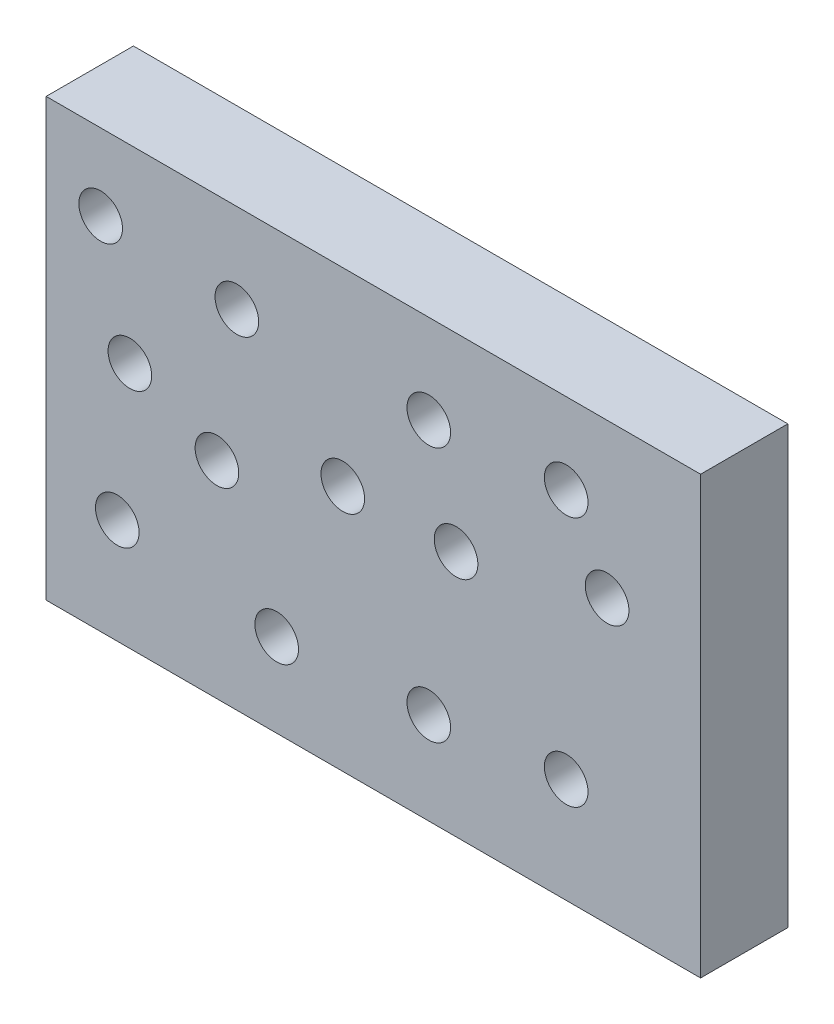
ISO-10303-21;
HEADER;
FILE_DESCRIPTION(('STEP AP214'),'2;1');
FILE_NAME('part.step','',(''),(''),'','','');
FILE_SCHEMA(('AUTOMOTIVE_DESIGN { 1 0 10303 214 1 1 1 1 }'));
ENDSEC;
DATA;
#1=APPLICATION_CONTEXT('core data for automotive mechanical design processes');
#2=APPLICATION_PROTOCOL_DEFINITION('international standard','automotive_design',2000,#1);
#3=PRODUCT_CONTEXT('',#1,'mechanical');
#4=PRODUCT('Part','Part','',(#3));
#5=PRODUCT_RELATED_PRODUCT_CATEGORY('part','',(#4));
#6=PRODUCT_DEFINITION_FORMATION('','',#4);
#7=PRODUCT_DEFINITION_CONTEXT('part definition',#1,'design');
#8=PRODUCT_DEFINITION('design','',#6,#7);
#9=PRODUCT_DEFINITION_SHAPE('','',#8);
#10=(LENGTH_UNIT() NAMED_UNIT(*) SI_UNIT(.MILLI.,.METRE.));
#11=(NAMED_UNIT(*) PLANE_ANGLE_UNIT() SI_UNIT($,.RADIAN.));
#12=(NAMED_UNIT(*) SI_UNIT($,.STERADIAN.) SOLID_ANGLE_UNIT());
#13=UNCERTAINTY_MEASURE_WITH_UNIT(LENGTH_MEASURE(1.E-05),#10,'distance_accuracy_value','');
#14=(GEOMETRIC_REPRESENTATION_CONTEXT(3) GLOBAL_UNCERTAINTY_ASSIGNED_CONTEXT((#13)) GLOBAL_UNIT_ASSIGNED_CONTEXT((#10,
#11,#12)) REPRESENTATION_CONTEXT('',''));
#15=CARTESIAN_POINT('',(0.,0.,0.));
#16=DIRECTION('',(0.,0.,1.));
#17=DIRECTION('',(1.,0.,0.));
#18=AXIS2_PLACEMENT_3D('',#15,#16,#17);
#19=CARTESIAN_POINT('',(0.,0.,40.));
#20=DIRECTION('',(1.,0.,0.));
#21=DIRECTION('',(0.,0.,-1.));
#22=AXIS2_PLACEMENT_3D('',#19,#20,#21);
#23=PLANE('',#22);
#24=DIRECTION('',(0.,-1.,0.));
#25=VECTOR('',#24,1.);
#26=CARTESIAN_POINT('',(0.,0.,0.));
#27=LINE('',#26,#25);
#28=CARTESIAN_POINT('',(0.,200.,0.));
#29=VERTEX_POINT('',#28);
#30=CARTESIAN_POINT('',(0.,0.,0.));
#31=VERTEX_POINT('',#30);
#32=EDGE_CURVE('E95',#29,#31,#27,.T.);
#33=ORIENTED_EDGE('',*,*,#32,.T.);
#34=DIRECTION('',(0.,0.,-1.));
#35=VECTOR('',#34,1.);
#36=CARTESIAN_POINT('',(0.,0.,40.));
#37=LINE('',#36,#35);
#38=CARTESIAN_POINT('',(0.,0.,40.));
#39=VERTEX_POINT('',#38);
#40=EDGE_CURVE('E11',#39,#31,#37,.T.);
#41=ORIENTED_EDGE('',*,*,#40,.F.);
#42=DIRECTION('',(0.,-1.,0.));
#43=VECTOR('',#42,1.);
#44=CARTESIAN_POINT('',(0.,0.,40.));
#45=LINE('',#44,#43);
#46=CARTESIAN_POINT('',(0.,200.,40.));
#47=VERTEX_POINT('',#46);
#48=EDGE_CURVE('E83',#47,#39,#45,.T.);
#49=ORIENTED_EDGE('',*,*,#48,.F.);
#50=DIRECTION('',(0.,0.,-1.));
#51=VECTOR('',#50,1.);
#52=CARTESIAN_POINT('',(0.,200.,40.));
#53=LINE('',#52,#51);
#54=EDGE_CURVE('E91',#47,#29,#53,.T.);
#55=ORIENTED_EDGE('',*,*,#54,.T.);
#56=EDGE_LOOP('',(#33,#41,#49,#55));
#57=FACE_BOUND('',#56,.T.);
#58=ADVANCED_FACE('F32',(#57),#23,.F.);
#59=CARTESIAN_POINT('',(0.,0.,40.));
#60=DIRECTION('',(0.,1.,0.));
#61=DIRECTION('',(0.,0.,1.));
#62=AXIS2_PLACEMENT_3D('',#59,#60,#61);
#63=PLANE('',#62);
#64=DIRECTION('',(1.,0.,0.));
#65=VECTOR('',#64,1.);
#66=CARTESIAN_POINT('',(0.,0.,0.));
#67=LINE('',#66,#65);
#68=CARTESIAN_POINT('',(300.,0.,0.));
#69=VERTEX_POINT('',#68);
#70=EDGE_CURVE('E87',#31,#69,#67,.T.);
#71=ORIENTED_EDGE('',*,*,#70,.T.);
#72=DIRECTION('',(0.,0.,-1.));
#73=VECTOR('',#72,1.);
#74=CARTESIAN_POINT('',(300.,0.,40.));
#75=LINE('',#74,#73);
#76=CARTESIAN_POINT('',(300.,0.,40.));
#77=VERTEX_POINT('',#76);
#78=EDGE_CURVE('E40',#77,#69,#75,.T.);
#79=ORIENTED_EDGE('',*,*,#78,.F.);
#80=DIRECTION('',(1.,0.,0.));
#81=VECTOR('',#80,1.);
#82=CARTESIAN_POINT('',(0.,0.,40.));
#83=LINE('',#82,#81);
#84=EDGE_CURVE('E78',#39,#77,#83,.T.);
#85=ORIENTED_EDGE('',*,*,#84,.F.);
#86=ORIENTED_EDGE('',*,*,#40,.T.);
#87=EDGE_LOOP('',(#71,#79,#85,#86));
#88=FACE_BOUND('',#87,.T.);
#89=ADVANCED_FACE('F86',(#88),#63,.F.);
#90=CARTESIAN_POINT('',(300.,0.,40.));
#91=DIRECTION('',(-1.,0.,0.));
#92=DIRECTION('',(0.,0.,1.));
#93=AXIS2_PLACEMENT_3D('',#90,#91,#92);
#94=PLANE('',#93);
#95=DIRECTION('',(0.,1.,0.));
#96=VECTOR('',#95,1.);
#97=CARTESIAN_POINT('',(300.,0.,0.));
#98=LINE('',#97,#96);
#99=CARTESIAN_POINT('',(300.,200.,0.));
#100=VERTEX_POINT('',#99);
#101=EDGE_CURVE('E65',#69,#100,#98,.T.);
#102=ORIENTED_EDGE('',*,*,#101,.T.);
#103=DIRECTION('',(0.,0.,-1.));
#104=VECTOR('',#103,1.);
#105=CARTESIAN_POINT('',(300.,200.,40.));
#106=LINE('',#105,#104);
#107=CARTESIAN_POINT('',(300.,200.,40.));
#108=VERTEX_POINT('',#107);
#109=EDGE_CURVE('E88',#108,#100,#106,.T.);
#110=ORIENTED_EDGE('',*,*,#109,.F.);
#111=DIRECTION('',(0.,1.,0.));
#112=VECTOR('',#111,1.);
#113=CARTESIAN_POINT('',(300.,0.,40.));
#114=LINE('',#113,#112);
#115=EDGE_CURVE('E81',#77,#108,#114,.T.);
#116=ORIENTED_EDGE('',*,*,#115,.F.);
#117=ORIENTED_EDGE('',*,*,#78,.T.);
#118=EDGE_LOOP('',(#102,#110,#116,#117));
#119=FACE_BOUND('',#118,.T.);
#120=ADVANCED_FACE('F89',(#119),#94,.F.);
#121=CARTESIAN_POINT('',(0.,200.,40.));
#122=DIRECTION('',(0.,-1.,0.));
#123=DIRECTION('',(0.,0.,-1.));
#124=AXIS2_PLACEMENT_3D('',#121,#122,#123);
#125=PLANE('',#124);
#126=DIRECTION('',(-1.,0.,0.));
#127=VECTOR('',#126,1.);
#128=CARTESIAN_POINT('',(0.,200.,0.));
#129=LINE('',#128,#127);
#130=EDGE_CURVE('E71',#100,#29,#129,.T.);
#131=ORIENTED_EDGE('',*,*,#130,.T.);
#132=ORIENTED_EDGE('',*,*,#54,.F.);
#133=DIRECTION('',(-1.,0.,0.));
#134=VECTOR('',#133,1.);
#135=CARTESIAN_POINT('',(0.,200.,40.));
#136=LINE('',#135,#134);
#137=EDGE_CURVE('E48',#108,#47,#136,.T.);
#138=ORIENTED_EDGE('',*,*,#137,.F.);
#139=ORIENTED_EDGE('',*,*,#109,.T.);
#140=EDGE_LOOP('',(#131,#132,#138,#139));
#141=FACE_BOUND('',#140,.T.);
#142=ADVANCED_FACE('F103',(#141),#125,.F.);
#143=CARTESIAN_POINT('',(0.,0.,40.));
#144=DIRECTION('',(0.,0.,-1.));
#145=DIRECTION('',(-1.,0.,0.));
#146=AXIS2_PLACEMENT_3D('',#143,#144,#145);
#147=PLANE('',#146);
#148=CARTESIAN_POINT('',(25.,165.,40.));
#149=DIRECTION('',(0.,0.,1.));
#150=DIRECTION('',(1.,0.,0.));
#151=AXIS2_PLACEMENT_3D('',#148,#149,#150);
#152=CIRCLE('',#151,9.99999999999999);
#153=CARTESIAN_POINT('',(35.,165.,40.));
#154=VERTEX_POINT('',#153);
#155=EDGE_CURVE('E183',#154,#154,#152,.T.);
#156=ORIENTED_EDGE('',*,*,#155,.F.);
#157=EDGE_LOOP('',(#156));
#158=FACE_BOUND('',#157,.T.);
#159=CARTESIAN_POINT('',(38.3780041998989,113.205738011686,40.));
#160=DIRECTION('',(0.,0.,1.));
#161=DIRECTION('',(1.,0.,0.));
#162=AXIS2_PLACEMENT_3D('',#159,#160,#161);
#163=CIRCLE('',#162,9.99999999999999);
#164=CARTESIAN_POINT('',(48.3780041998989,113.205738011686,40.));
#165=VERTEX_POINT('',#164);
#166=EDGE_CURVE('E177',#165,#165,#163,.T.);
#167=ORIENTED_EDGE('',*,*,#166,.F.);
#168=EDGE_LOOP('',(#167));
#169=FACE_BOUND('',#168,.T.);
#170=CARTESIAN_POINT('',(87.4191920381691,159.203096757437,40.));
#171=DIRECTION('',(0.,0.,1.));
#172=DIRECTION('',(1.,0.,0.));
#173=AXIS2_PLACEMENT_3D('',#170,#171,#172);
#174=CIRCLE('',#173,9.99999999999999);
#175=CARTESIAN_POINT('',(97.4191920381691,159.203096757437,40.));
#176=VERTEX_POINT('',#175);
#177=EDGE_CURVE('E171',#176,#176,#174,.T.);
#178=ORIENTED_EDGE('',*,*,#177,.F.);
#179=EDGE_LOOP('',(#178));
#180=FACE_BOUND('',#179,.T.);
#181=CARTESIAN_POINT('',(78.2840688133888,94.6312746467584,40.));
#182=DIRECTION('',(0.,0.,1.));
#183=DIRECTION('',(1.,0.,0.));
#184=AXIS2_PLACEMENT_3D('',#181,#182,#183);
#185=CIRCLE('',#184,9.99999999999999);
#186=CARTESIAN_POINT('',(88.2840688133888,94.6312746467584,40.));
#187=VERTEX_POINT('',#186);
#188=EDGE_CURVE('E165',#187,#187,#185,.T.);
#189=ORIENTED_EDGE('',*,*,#188,.F.);
#190=EDGE_LOOP('',(#189));
#191=FACE_BOUND('',#190,.T.);
#192=CARTESIAN_POINT('',(32.6084526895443,48.0894418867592,40.));
#193=DIRECTION('',(0.,0.,1.));
#194=DIRECTION('',(1.,0.,0.));
#195=AXIS2_PLACEMENT_3D('',#192,#193,#194);
#196=CIRCLE('',#195,9.99999999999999);
#197=CARTESIAN_POINT('',(42.6084526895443,48.0894418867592,40.));
#198=VERTEX_POINT('',#197);
#199=EDGE_CURVE('E159',#198,#198,#196,.T.);
#200=ORIENTED_EDGE('',*,*,#199,.F.);
#201=EDGE_LOOP('',(#200));
#202=FACE_BOUND('',#201,.T.);
#203=CARTESIAN_POINT('',(105.689438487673,38.321771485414,40.));
#204=DIRECTION('',(0.,0.,1.));
#205=DIRECTION('',(1.,0.,0.));
#206=AXIS2_PLACEMENT_3D('',#203,#204,#205);
#207=CIRCLE('',#206,9.99999999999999);
#208=CARTESIAN_POINT('',(115.689438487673,38.321771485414,40.));
#209=VERTEX_POINT('',#208);
#210=EDGE_CURVE('E153',#209,#209,#207,.T.);
#211=ORIENTED_EDGE('',*,*,#210,.F.);
#212=EDGE_LOOP('',(#211));
#213=FACE_BOUND('',#212,.T.);
#214=CARTESIAN_POINT('',(135.979583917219,113.205738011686,40.));
#215=DIRECTION('',(0.,0.,1.));
#216=DIRECTION('',(1.,0.,0.));
#217=AXIS2_PLACEMENT_3D('',#214,#215,#216);
#218=CIRCLE('',#217,10.);
#219=CARTESIAN_POINT('',(145.979583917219,113.205738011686,40.));
#220=VERTEX_POINT('',#219);
#221=EDGE_CURVE('E147',#220,#220,#218,.T.);
#222=ORIENTED_EDGE('',*,*,#221,.F.);
#223=EDGE_LOOP('',(#222));
#224=FACE_BOUND('',#223,.T.);
#225=CARTESIAN_POINT('',(187.905547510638,113.205738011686,40.));
#226=DIRECTION('',(0.,0.,1.));
#227=DIRECTION('',(1.,0.,0.));
#228=AXIS2_PLACEMENT_3D('',#225,#226,#227);
#229=CIRCLE('',#228,10.);
#230=CARTESIAN_POINT('',(197.905547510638,113.205738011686,40.));
#231=VERTEX_POINT('',#230);
#232=EDGE_CURVE('E141',#231,#231,#229,.T.);
#233=ORIENTED_EDGE('',*,*,#232,.F.);
#234=EDGE_LOOP('',(#233));
#235=FACE_BOUND('',#234,.T.);
#236=CARTESIAN_POINT('',(175.404852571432,159.203096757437,40.));
#237=DIRECTION('',(0.,0.,1.));
#238=DIRECTION('',(1.,0.,0.));
#239=AXIS2_PLACEMENT_3D('',#236,#237,#238);
#240=CIRCLE('',#239,10.);
#241=CARTESIAN_POINT('',(185.404852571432,159.203096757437,40.));
#242=VERTEX_POINT('',#241);
#243=EDGE_CURVE('E135',#242,#242,#240,.T.);
#244=ORIENTED_EDGE('',*,*,#243,.F.);
#245=EDGE_LOOP('',(#244));
#246=FACE_BOUND('',#245,.T.);
#247=CARTESIAN_POINT('',(175.404852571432,42.174728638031,40.));
#248=DIRECTION('',(0.,0.,1.));
#249=DIRECTION('',(1.,0.,0.));
#250=AXIS2_PLACEMENT_3D('',#247,#248,#249);
#251=CIRCLE('',#250,10.);
#252=CARTESIAN_POINT('',(185.404852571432,42.174728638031,40.));
#253=VERTEX_POINT('',#252);
#254=EDGE_CURVE('E129',#253,#253,#251,.T.);
#255=ORIENTED_EDGE('',*,*,#254,.F.);
#256=EDGE_LOOP('',(#255));
#257=FACE_BOUND('',#256,.T.);
#258=CARTESIAN_POINT('',(238.389123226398,48.0894418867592,40.));
#259=DIRECTION('',(0.,0.,1.));
#260=DIRECTION('',(1.,0.,0.));
#261=AXIS2_PLACEMENT_3D('',#258,#259,#260);
#262=CIRCLE('',#261,10.);
#263=CARTESIAN_POINT('',(248.389123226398,48.0894418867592,40.));
#264=VERTEX_POINT('',#263);
#265=EDGE_CURVE('E123',#264,#264,#262,.T.);
#266=ORIENTED_EDGE('',*,*,#265,.F.);
#267=EDGE_LOOP('',(#266));
#268=FACE_BOUND('',#267,.T.);
#269=CARTESIAN_POINT('',(257.140165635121,129.407381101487,40.));
#270=DIRECTION('',(0.,0.,1.));
#271=DIRECTION('',(1.,0.,0.));
#272=AXIS2_PLACEMENT_3D('',#269,#270,#271);
#273=CIRCLE('',#272,10.);
#274=CARTESIAN_POINT('',(267.140165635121,129.407381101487,40.));
#275=VERTEX_POINT('',#274);
#276=EDGE_CURVE('E117',#275,#275,#273,.T.);
#277=ORIENTED_EDGE('',*,*,#276,.F.);
#278=EDGE_LOOP('',(#277));
#279=FACE_BOUND('',#278,.T.);
#280=CARTESIAN_POINT('',(238.389123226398,162.959045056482,40.));
#281=DIRECTION('',(0.,0.,1.));
#282=DIRECTION('',(1.,0.,0.));
#283=AXIS2_PLACEMENT_3D('',#280,#281,#282);
#284=CIRCLE('',#283,10.);
#285=CARTESIAN_POINT('',(248.389123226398,162.959045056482,40.));
#286=VERTEX_POINT('',#285);
#287=EDGE_CURVE('E111',#286,#286,#284,.T.);
#288=ORIENTED_EDGE('',*,*,#287,.F.);
#289=EDGE_LOOP('',(#288));
#290=FACE_BOUND('',#289,.T.);
#291=ORIENTED_EDGE('',*,*,#48,.T.);
#292=ORIENTED_EDGE('',*,*,#84,.T.);
#293=ORIENTED_EDGE('',*,*,#115,.T.);
#294=ORIENTED_EDGE('',*,*,#137,.T.);
#295=EDGE_LOOP('',(#291,#292,#293,#294));
#296=FACE_BOUND('',#295,.T.);
#297=ADVANCED_FACE('F79',(#158,#169,#180,#191,#202,#213,#224,#235,#246,#257,#268,#279,#290,
#296),#147,.F.);
#298=CARTESIAN_POINT('',(0.,0.,0.));
#299=DIRECTION('',(0.,0.,-1.));
#300=DIRECTION('',(-1.,0.,0.));
#301=AXIS2_PLACEMENT_3D('',#298,#299,#300);
#302=PLANE('',#301);
#303=CARTESIAN_POINT('',(25.,165.,0.));
#304=DIRECTION('',(0.,0.,1.));
#305=DIRECTION('',(1.,0.,0.));
#306=AXIS2_PLACEMENT_3D('',#303,#304,#305);
#307=CIRCLE('',#306,9.99999999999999);
#308=CARTESIAN_POINT('',(35.,165.,0.));
#309=VERTEX_POINT('',#308);
#310=EDGE_CURVE('E180',#309,#309,#307,.T.);
#311=ORIENTED_EDGE('',*,*,#310,.T.);
#312=EDGE_LOOP('',(#311));
#313=FACE_BOUND('',#312,.T.);
#314=CARTESIAN_POINT('',(38.3780041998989,113.205738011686,0.));
#315=DIRECTION('',(0.,0.,1.));
#316=DIRECTION('',(1.,0.,0.));
#317=AXIS2_PLACEMENT_3D('',#314,#315,#316);
#318=CIRCLE('',#317,9.99999999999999);
#319=CARTESIAN_POINT('',(48.3780041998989,113.205738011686,0.));
#320=VERTEX_POINT('',#319);
#321=EDGE_CURVE('E174',#320,#320,#318,.T.);
#322=ORIENTED_EDGE('',*,*,#321,.T.);
#323=EDGE_LOOP('',(#322));
#324=FACE_BOUND('',#323,.T.);
#325=CARTESIAN_POINT('',(87.4191920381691,159.203096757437,0.));
#326=DIRECTION('',(0.,0.,1.));
#327=DIRECTION('',(1.,0.,0.));
#328=AXIS2_PLACEMENT_3D('',#325,#326,#327);
#329=CIRCLE('',#328,9.99999999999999);
#330=CARTESIAN_POINT('',(97.4191920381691,159.203096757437,0.));
#331=VERTEX_POINT('',#330);
#332=EDGE_CURVE('E168',#331,#331,#329,.T.);
#333=ORIENTED_EDGE('',*,*,#332,.T.);
#334=EDGE_LOOP('',(#333));
#335=FACE_BOUND('',#334,.T.);
#336=CARTESIAN_POINT('',(78.2840688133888,94.6312746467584,0.));
#337=DIRECTION('',(0.,0.,1.));
#338=DIRECTION('',(1.,0.,0.));
#339=AXIS2_PLACEMENT_3D('',#336,#337,#338);
#340=CIRCLE('',#339,9.99999999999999);
#341=CARTESIAN_POINT('',(88.2840688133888,94.6312746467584,0.));
#342=VERTEX_POINT('',#341);
#343=EDGE_CURVE('E162',#342,#342,#340,.T.);
#344=ORIENTED_EDGE('',*,*,#343,.T.);
#345=EDGE_LOOP('',(#344));
#346=FACE_BOUND('',#345,.T.);
#347=CARTESIAN_POINT('',(32.6084526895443,48.0894418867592,0.));
#348=DIRECTION('',(0.,0.,1.));
#349=DIRECTION('',(1.,0.,0.));
#350=AXIS2_PLACEMENT_3D('',#347,#348,#349);
#351=CIRCLE('',#350,9.99999999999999);
#352=CARTESIAN_POINT('',(42.6084526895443,48.0894418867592,0.));
#353=VERTEX_POINT('',#352);
#354=EDGE_CURVE('E156',#353,#353,#351,.T.);
#355=ORIENTED_EDGE('',*,*,#354,.T.);
#356=EDGE_LOOP('',(#355));
#357=FACE_BOUND('',#356,.T.);
#358=CARTESIAN_POINT('',(105.689438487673,38.321771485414,0.));
#359=DIRECTION('',(0.,0.,1.));
#360=DIRECTION('',(1.,0.,0.));
#361=AXIS2_PLACEMENT_3D('',#358,#359,#360);
#362=CIRCLE('',#361,9.99999999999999);
#363=CARTESIAN_POINT('',(115.689438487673,38.321771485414,0.));
#364=VERTEX_POINT('',#363);
#365=EDGE_CURVE('E150',#364,#364,#362,.T.);
#366=ORIENTED_EDGE('',*,*,#365,.T.);
#367=EDGE_LOOP('',(#366));
#368=FACE_BOUND('',#367,.T.);
#369=CARTESIAN_POINT('',(135.979583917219,113.205738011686,0.));
#370=DIRECTION('',(0.,0.,1.));
#371=DIRECTION('',(1.,0.,0.));
#372=AXIS2_PLACEMENT_3D('',#369,#370,#371);
#373=CIRCLE('',#372,10.);
#374=CARTESIAN_POINT('',(145.979583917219,113.205738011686,0.));
#375=VERTEX_POINT('',#374);
#376=EDGE_CURVE('E144',#375,#375,#373,.T.);
#377=ORIENTED_EDGE('',*,*,#376,.T.);
#378=EDGE_LOOP('',(#377));
#379=FACE_BOUND('',#378,.T.);
#380=CARTESIAN_POINT('',(187.905547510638,113.205738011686,0.));
#381=DIRECTION('',(0.,0.,1.));
#382=DIRECTION('',(1.,0.,0.));
#383=AXIS2_PLACEMENT_3D('',#380,#381,#382);
#384=CIRCLE('',#383,10.);
#385=CARTESIAN_POINT('',(197.905547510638,113.205738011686,0.));
#386=VERTEX_POINT('',#385);
#387=EDGE_CURVE('E138',#386,#386,#384,.T.);
#388=ORIENTED_EDGE('',*,*,#387,.T.);
#389=EDGE_LOOP('',(#388));
#390=FACE_BOUND('',#389,.T.);
#391=CARTESIAN_POINT('',(175.404852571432,159.203096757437,0.));
#392=DIRECTION('',(0.,0.,1.));
#393=DIRECTION('',(1.,0.,0.));
#394=AXIS2_PLACEMENT_3D('',#391,#392,#393);
#395=CIRCLE('',#394,10.);
#396=CARTESIAN_POINT('',(185.404852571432,159.203096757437,0.));
#397=VERTEX_POINT('',#396);
#398=EDGE_CURVE('E132',#397,#397,#395,.T.);
#399=ORIENTED_EDGE('',*,*,#398,.T.);
#400=EDGE_LOOP('',(#399));
#401=FACE_BOUND('',#400,.T.);
#402=CARTESIAN_POINT('',(175.404852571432,42.174728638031,0.));
#403=DIRECTION('',(0.,0.,1.));
#404=DIRECTION('',(1.,0.,0.));
#405=AXIS2_PLACEMENT_3D('',#402,#403,#404);
#406=CIRCLE('',#405,10.);
#407=CARTESIAN_POINT('',(185.404852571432,42.174728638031,0.));
#408=VERTEX_POINT('',#407);
#409=EDGE_CURVE('E126',#408,#408,#406,.T.);
#410=ORIENTED_EDGE('',*,*,#409,.T.);
#411=EDGE_LOOP('',(#410));
#412=FACE_BOUND('',#411,.T.);
#413=CARTESIAN_POINT('',(238.389123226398,48.0894418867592,0.));
#414=DIRECTION('',(0.,0.,1.));
#415=DIRECTION('',(1.,0.,0.));
#416=AXIS2_PLACEMENT_3D('',#413,#414,#415);
#417=CIRCLE('',#416,10.);
#418=CARTESIAN_POINT('',(248.389123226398,48.0894418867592,0.));
#419=VERTEX_POINT('',#418);
#420=EDGE_CURVE('E120',#419,#419,#417,.T.);
#421=ORIENTED_EDGE('',*,*,#420,.T.);
#422=EDGE_LOOP('',(#421));
#423=FACE_BOUND('',#422,.T.);
#424=CARTESIAN_POINT('',(257.140165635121,129.407381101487,0.));
#425=DIRECTION('',(0.,0.,1.));
#426=DIRECTION('',(1.,0.,0.));
#427=AXIS2_PLACEMENT_3D('',#424,#425,#426);
#428=CIRCLE('',#427,10.);
#429=CARTESIAN_POINT('',(267.140165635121,129.407381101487,0.));
#430=VERTEX_POINT('',#429);
#431=EDGE_CURVE('E114',#430,#430,#428,.T.);
#432=ORIENTED_EDGE('',*,*,#431,.T.);
#433=EDGE_LOOP('',(#432));
#434=FACE_BOUND('',#433,.T.);
#435=CARTESIAN_POINT('',(238.389123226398,162.959045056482,0.));
#436=DIRECTION('',(0.,0.,1.));
#437=DIRECTION('',(1.,0.,0.));
#438=AXIS2_PLACEMENT_3D('',#435,#436,#437);
#439=CIRCLE('',#438,10.);
#440=CARTESIAN_POINT('',(248.389123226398,162.959045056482,0.));
#441=VERTEX_POINT('',#440);
#442=EDGE_CURVE('E98',#441,#441,#439,.T.);
#443=ORIENTED_EDGE('',*,*,#442,.T.);
#444=EDGE_LOOP('',(#443));
#445=FACE_BOUND('',#444,.T.);
#446=ORIENTED_EDGE('',*,*,#32,.F.);
#447=ORIENTED_EDGE('',*,*,#130,.F.);
#448=ORIENTED_EDGE('',*,*,#101,.F.);
#449=ORIENTED_EDGE('',*,*,#70,.F.);
#450=EDGE_LOOP('',(#446,#447,#448,#449));
#451=FACE_BOUND('',#450,.T.);
#452=ADVANCED_FACE('F106',(#313,#324,#335,#346,#357,#368,#379,#390,#401,#412,#423,#434,#445,
#451),#302,.T.);
#453=CARTESIAN_POINT('',(238.389123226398,162.959045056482,40.));
#454=DIRECTION('',(0.,0.,1.));
#455=DIRECTION('',(1.,0.,0.));
#456=AXIS2_PLACEMENT_3D('',#453,#454,#455);
#457=CYLINDRICAL_SURFACE('',#456,10.);
#458=ORIENTED_EDGE('',*,*,#442,.F.);
#459=EDGE_LOOP('',(#458));
#460=FACE_BOUND('',#459,.T.);
#461=ORIENTED_EDGE('',*,*,#287,.T.);
#462=EDGE_LOOP('',(#461));
#463=FACE_BOUND('',#462,.T.);
#464=ADVANCED_FACE('F216',(#460,#463),#457,.F.);
#465=CARTESIAN_POINT('',(257.140165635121,129.407381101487,40.));
#466=DIRECTION('',(0.,0.,1.));
#467=DIRECTION('',(1.,0.,0.));
#468=AXIS2_PLACEMENT_3D('',#465,#466,#467);
#469=CYLINDRICAL_SURFACE('',#468,10.);
#470=ORIENTED_EDGE('',*,*,#431,.F.);
#471=EDGE_LOOP('',(#470));
#472=FACE_BOUND('',#471,.T.);
#473=ORIENTED_EDGE('',*,*,#276,.T.);
#474=EDGE_LOOP('',(#473));
#475=FACE_BOUND('',#474,.T.);
#476=ADVANCED_FACE('F218',(#472,#475),#469,.F.);
#477=CARTESIAN_POINT('',(238.389123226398,48.0894418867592,40.));
#478=DIRECTION('',(0.,0.,1.));
#479=DIRECTION('',(1.,0.,0.));
#480=AXIS2_PLACEMENT_3D('',#477,#478,#479);
#481=CYLINDRICAL_SURFACE('',#480,10.);
#482=ORIENTED_EDGE('',*,*,#420,.F.);
#483=EDGE_LOOP('',(#482));
#484=FACE_BOUND('',#483,.T.);
#485=ORIENTED_EDGE('',*,*,#265,.T.);
#486=EDGE_LOOP('',(#485));
#487=FACE_BOUND('',#486,.T.);
#488=ADVANCED_FACE('F225',(#484,#487),#481,.F.);
#489=CARTESIAN_POINT('',(175.404852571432,42.174728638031,40.));
#490=DIRECTION('',(0.,0.,1.));
#491=DIRECTION('',(1.,0.,0.));
#492=AXIS2_PLACEMENT_3D('',#489,#490,#491);
#493=CYLINDRICAL_SURFACE('',#492,10.);
#494=ORIENTED_EDGE('',*,*,#409,.F.);
#495=EDGE_LOOP('',(#494));
#496=FACE_BOUND('',#495,.T.);
#497=ORIENTED_EDGE('',*,*,#254,.T.);
#498=EDGE_LOOP('',(#497));
#499=FACE_BOUND('',#498,.T.);
#500=ADVANCED_FACE('F272',(#496,#499),#493,.F.);
#501=CARTESIAN_POINT('',(175.404852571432,159.203096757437,40.));
#502=DIRECTION('',(0.,0.,1.));
#503=DIRECTION('',(1.,0.,0.));
#504=AXIS2_PLACEMENT_3D('',#501,#502,#503);
#505=CYLINDRICAL_SURFACE('',#504,10.);
#506=ORIENTED_EDGE('',*,*,#398,.F.);
#507=EDGE_LOOP('',(#506));
#508=FACE_BOUND('',#507,.T.);
#509=ORIENTED_EDGE('',*,*,#243,.T.);
#510=EDGE_LOOP('',(#509));
#511=FACE_BOUND('',#510,.T.);
#512=ADVANCED_FACE('F282',(#508,#511),#505,.F.);
#513=CARTESIAN_POINT('',(187.905547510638,113.205738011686,40.));
#514=DIRECTION('',(0.,0.,1.));
#515=DIRECTION('',(1.,0.,0.));
#516=AXIS2_PLACEMENT_3D('',#513,#514,#515);
#517=CYLINDRICAL_SURFACE('',#516,10.);
#518=ORIENTED_EDGE('',*,*,#387,.F.);
#519=EDGE_LOOP('',(#518));
#520=FACE_BOUND('',#519,.T.);
#521=ORIENTED_EDGE('',*,*,#232,.T.);
#522=EDGE_LOOP('',(#521));
#523=FACE_BOUND('',#522,.T.);
#524=ADVANCED_FACE('F292',(#520,#523),#517,.F.);
#525=CARTESIAN_POINT('',(135.979583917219,113.205738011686,40.));
#526=DIRECTION('',(0.,0.,1.));
#527=DIRECTION('',(1.,0.,0.));
#528=AXIS2_PLACEMENT_3D('',#525,#526,#527);
#529=CYLINDRICAL_SURFACE('',#528,10.);
#530=ORIENTED_EDGE('',*,*,#376,.F.);
#531=EDGE_LOOP('',(#530));
#532=FACE_BOUND('',#531,.T.);
#533=ORIENTED_EDGE('',*,*,#221,.T.);
#534=EDGE_LOOP('',(#533));
#535=FACE_BOUND('',#534,.T.);
#536=ADVANCED_FACE('F302',(#532,#535),#529,.F.);
#537=CARTESIAN_POINT('',(105.689438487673,38.321771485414,40.));
#538=DIRECTION('',(0.,0.,1.));
#539=DIRECTION('',(1.,0.,0.));
#540=AXIS2_PLACEMENT_3D('',#537,#538,#539);
#541=CYLINDRICAL_SURFACE('',#540,9.99999999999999);
#542=ORIENTED_EDGE('',*,*,#365,.F.);
#543=EDGE_LOOP('',(#542));
#544=FACE_BOUND('',#543,.T.);
#545=ORIENTED_EDGE('',*,*,#210,.T.);
#546=EDGE_LOOP('',(#545));
#547=FACE_BOUND('',#546,.T.);
#548=ADVANCED_FACE('F312',(#544,#547),#541,.F.);
#549=CARTESIAN_POINT('',(32.6084526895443,48.0894418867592,40.));
#550=DIRECTION('',(0.,0.,1.));
#551=DIRECTION('',(1.,0.,0.));
#552=AXIS2_PLACEMENT_3D('',#549,#550,#551);
#553=CYLINDRICAL_SURFACE('',#552,9.99999999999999);
#554=ORIENTED_EDGE('',*,*,#354,.F.);
#555=EDGE_LOOP('',(#554));
#556=FACE_BOUND('',#555,.T.);
#557=ORIENTED_EDGE('',*,*,#199,.T.);
#558=EDGE_LOOP('',(#557));
#559=FACE_BOUND('',#558,.T.);
#560=ADVANCED_FACE('F322',(#556,#559),#553,.F.);
#561=CARTESIAN_POINT('',(78.2840688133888,94.6312746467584,40.));
#562=DIRECTION('',(0.,0.,1.));
#563=DIRECTION('',(1.,0.,0.));
#564=AXIS2_PLACEMENT_3D('',#561,#562,#563);
#565=CYLINDRICAL_SURFACE('',#564,9.99999999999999);
#566=ORIENTED_EDGE('',*,*,#343,.F.);
#567=EDGE_LOOP('',(#566));
#568=FACE_BOUND('',#567,.T.);
#569=ORIENTED_EDGE('',*,*,#188,.T.);
#570=EDGE_LOOP('',(#569));
#571=FACE_BOUND('',#570,.T.);
#572=ADVANCED_FACE('F332',(#568,#571),#565,.F.);
#573=CARTESIAN_POINT('',(87.4191920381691,159.203096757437,40.));
#574=DIRECTION('',(0.,0.,1.));
#575=DIRECTION('',(1.,0.,0.));
#576=AXIS2_PLACEMENT_3D('',#573,#574,#575);
#577=CYLINDRICAL_SURFACE('',#576,9.99999999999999);
#578=ORIENTED_EDGE('',*,*,#332,.F.);
#579=EDGE_LOOP('',(#578));
#580=FACE_BOUND('',#579,.T.);
#581=ORIENTED_EDGE('',*,*,#177,.T.);
#582=EDGE_LOOP('',(#581));
#583=FACE_BOUND('',#582,.T.);
#584=ADVANCED_FACE('F342',(#580,#583),#577,.F.);
#585=CARTESIAN_POINT('',(38.3780041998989,113.205738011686,40.));
#586=DIRECTION('',(0.,0.,1.));
#587=DIRECTION('',(1.,0.,0.));
#588=AXIS2_PLACEMENT_3D('',#585,#586,#587);
#589=CYLINDRICAL_SURFACE('',#588,9.99999999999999);
#590=ORIENTED_EDGE('',*,*,#321,.F.);
#591=EDGE_LOOP('',(#590));
#592=FACE_BOUND('',#591,.T.);
#593=ORIENTED_EDGE('',*,*,#166,.T.);
#594=EDGE_LOOP('',(#593));
#595=FACE_BOUND('',#594,.T.);
#596=ADVANCED_FACE('F352',(#592,#595),#589,.F.);
#597=CARTESIAN_POINT('',(25.,165.,40.));
#598=DIRECTION('',(0.,0.,1.));
#599=DIRECTION('',(1.,0.,0.));
#600=AXIS2_PLACEMENT_3D('',#597,#598,#599);
#601=CYLINDRICAL_SURFACE('',#600,9.99999999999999);
#602=ORIENTED_EDGE('',*,*,#310,.F.);
#603=EDGE_LOOP('',(#602));
#604=FACE_BOUND('',#603,.T.);
#605=ORIENTED_EDGE('',*,*,#155,.T.);
#606=EDGE_LOOP('',(#605));
#607=FACE_BOUND('',#606,.T.);
#608=ADVANCED_FACE('F187',(#604,#607),#601,.F.);
#609=CLOSED_SHELL('',(#58,#89,#120,#142,#297,#452,#464,#476,#488,#500,#512,#524,#536,#548,#560,
#572,#584,#596,#608));
#610=MANIFOLD_SOLID_BREP('B2',#609);
#611=ADVANCED_BREP_SHAPE_REPRESENTATION('',(#18,#610),#14);
#612=SHAPE_DEFINITION_REPRESENTATION(#9,#611);
ENDSEC;
END-ISO-10303-21;
